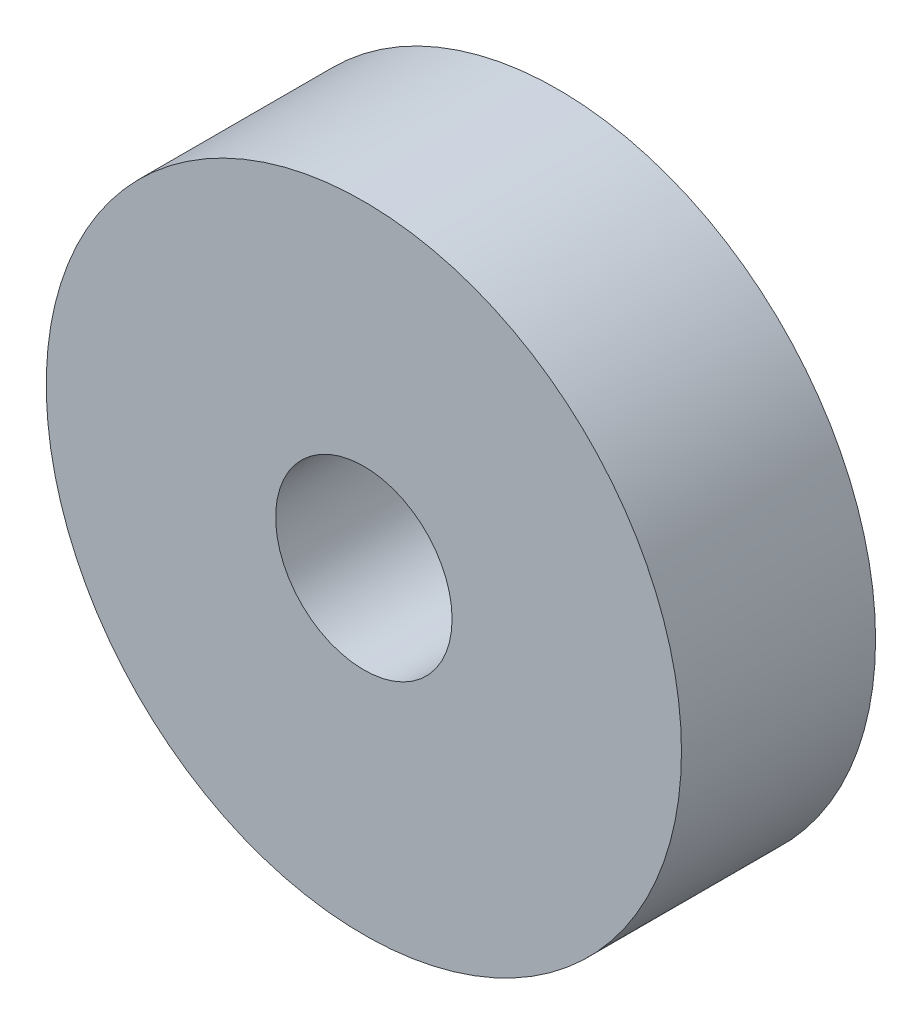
ISO-10303-21;
HEADER;
FILE_DESCRIPTION(('STEP AP214'),'2;1');
FILE_NAME('part.step','',(''),(''),'','','');
FILE_SCHEMA(('AUTOMOTIVE_DESIGN { 1 0 10303 214 1 1 1 1 }'));
ENDSEC;
DATA;
#1=APPLICATION_CONTEXT('core data for automotive mechanical design processes');
#2=APPLICATION_PROTOCOL_DEFINITION('international standard','automotive_design',2000,#1);
#3=PRODUCT_CONTEXT('',#1,'mechanical');
#4=PRODUCT('Part','Part','',(#3));
#5=PRODUCT_RELATED_PRODUCT_CATEGORY('part','',(#4));
#6=PRODUCT_DEFINITION_FORMATION('','',#4);
#7=PRODUCT_DEFINITION_CONTEXT('part definition',#1,'design');
#8=PRODUCT_DEFINITION('design','',#6,#7);
#9=PRODUCT_DEFINITION_SHAPE('','',#8);
#10=(LENGTH_UNIT() NAMED_UNIT(*) SI_UNIT(.MILLI.,.METRE.));
#11=(NAMED_UNIT(*) PLANE_ANGLE_UNIT() SI_UNIT($,.RADIAN.));
#12=(NAMED_UNIT(*) SI_UNIT($,.STERADIAN.) SOLID_ANGLE_UNIT());
#13=UNCERTAINTY_MEASURE_WITH_UNIT(LENGTH_MEASURE(1.E-05),#10,'distance_accuracy_value','');
#14=(GEOMETRIC_REPRESENTATION_CONTEXT(3) GLOBAL_UNCERTAINTY_ASSIGNED_CONTEXT((#13)) GLOBAL_UNIT_ASSIGNED_CONTEXT((#10,
#11,#12)) REPRESENTATION_CONTEXT('',''));
#15=CARTESIAN_POINT('',(0.,0.,0.));
#16=DIRECTION('',(0.,0.,1.));
#17=DIRECTION('',(1.,0.,0.));
#18=AXIS2_PLACEMENT_3D('',#15,#16,#17);
#19=CARTESIAN_POINT('',(0.,0.,5.5));
#20=DIRECTION('',(0.,0.,1.));
#21=DIRECTION('',(1.,0.,0.));
#22=AXIS2_PLACEMENT_3D('',#19,#20,#21);
#23=PLANE('',#22);
#24=CARTESIAN_POINT('',(0.,0.,5.5));
#25=DIRECTION('',(0.,0.,1.));
#26=DIRECTION('',(1.,0.,0.));
#27=AXIS2_PLACEMENT_3D('',#24,#25,#26);
#28=CIRCLE('',#27,9.);
#29=CARTESIAN_POINT('',(9.,0.,5.5));
#30=VERTEX_POINT('',#29);
#31=EDGE_CURVE('E10',#30,#30,#28,.T.);
#32=ORIENTED_EDGE('',*,*,#31,.T.);
#33=EDGE_LOOP('',(#32));
#34=FACE_BOUND('',#33,.T.);
#35=CARTESIAN_POINT('',(0.,0.,5.5));
#36=DIRECTION('',(0.,0.,1.));
#37=DIRECTION('',(1.,0.,0.));
#38=AXIS2_PLACEMENT_3D('',#35,#36,#37);
#39=CIRCLE('',#38,2.5);
#40=CARTESIAN_POINT('',(2.5,0.,5.5));
#41=VERTEX_POINT('',#40);
#42=EDGE_CURVE('E50',#41,#41,#39,.T.);
#43=ORIENTED_EDGE('',*,*,#42,.F.);
#44=EDGE_LOOP('',(#43));
#45=FACE_BOUND('',#44,.T.);
#46=ADVANCED_FACE('F37',(#34,#45),#23,.T.);
#47=CARTESIAN_POINT('',(0.,0.,0.));
#48=DIRECTION('',(0.,0.,1.));
#49=DIRECTION('',(1.,0.,0.));
#50=AXIS2_PLACEMENT_3D('',#47,#48,#49);
#51=PLANE('',#50);
#52=CARTESIAN_POINT('',(0.,0.,0.));
#53=DIRECTION('',(0.,0.,1.));
#54=DIRECTION('',(1.,0.,0.));
#55=AXIS2_PLACEMENT_3D('',#52,#53,#54);
#56=CIRCLE('',#55,9.);
#57=CARTESIAN_POINT('',(9.,0.,0.));
#58=VERTEX_POINT('',#57);
#59=EDGE_CURVE('E41',#58,#58,#56,.T.);
#60=ORIENTED_EDGE('',*,*,#59,.F.);
#61=EDGE_LOOP('',(#60));
#62=FACE_BOUND('',#61,.T.);
#63=CARTESIAN_POINT('',(0.,0.,0.));
#64=DIRECTION('',(0.,0.,1.));
#65=DIRECTION('',(1.,0.,0.));
#66=AXIS2_PLACEMENT_3D('',#63,#64,#65);
#67=CIRCLE('',#66,2.5);
#68=CARTESIAN_POINT('',(2.5,0.,0.));
#69=VERTEX_POINT('',#68);
#70=EDGE_CURVE('E52',#69,#69,#67,.T.);
#71=ORIENTED_EDGE('',*,*,#70,.T.);
#72=EDGE_LOOP('',(#71));
#73=FACE_BOUND('',#72,.T.);
#74=ADVANCED_FACE('F64',(#62,#73),#51,.F.);
#75=CARTESIAN_POINT('',(0.,0.,5.5));
#76=DIRECTION('',(0.,0.,-1.));
#77=DIRECTION('',(-1.,0.,0.));
#78=AXIS2_PLACEMENT_3D('',#75,#76,#77);
#79=CYLINDRICAL_SURFACE('',#78,9.);
#80=ORIENTED_EDGE('',*,*,#31,.F.);
#81=EDGE_LOOP('',(#80));
#82=FACE_BOUND('',#81,.T.);
#83=ORIENTED_EDGE('',*,*,#59,.T.);
#84=EDGE_LOOP('',(#83));
#85=FACE_BOUND('',#84,.T.);
#86=ADVANCED_FACE('F39',(#82,#85),#79,.T.);
#87=CARTESIAN_POINT('',(0.,0.,5.5));
#88=DIRECTION('',(0.,0.,-1.));
#89=DIRECTION('',(-1.,0.,0.));
#90=AXIS2_PLACEMENT_3D('',#87,#88,#89);
#91=CYLINDRICAL_SURFACE('',#90,2.5);
#92=ORIENTED_EDGE('',*,*,#42,.T.);
#93=EDGE_LOOP('',(#92));
#94=FACE_BOUND('',#93,.T.);
#95=ORIENTED_EDGE('',*,*,#70,.F.);
#96=EDGE_LOOP('',(#95));
#97=FACE_BOUND('',#96,.T.);
#98=ADVANCED_FACE('F60',(#94,#97),#91,.F.);
#99=CLOSED_SHELL('',(#46,#74,#86,#98));
#100=MANIFOLD_SOLID_BREP('B2',#99);
#101=ADVANCED_BREP_SHAPE_REPRESENTATION('',(#18,#100),#14);
#102=SHAPE_DEFINITION_REPRESENTATION(#9,#101);
ENDSEC;
END-ISO-10303-21;
